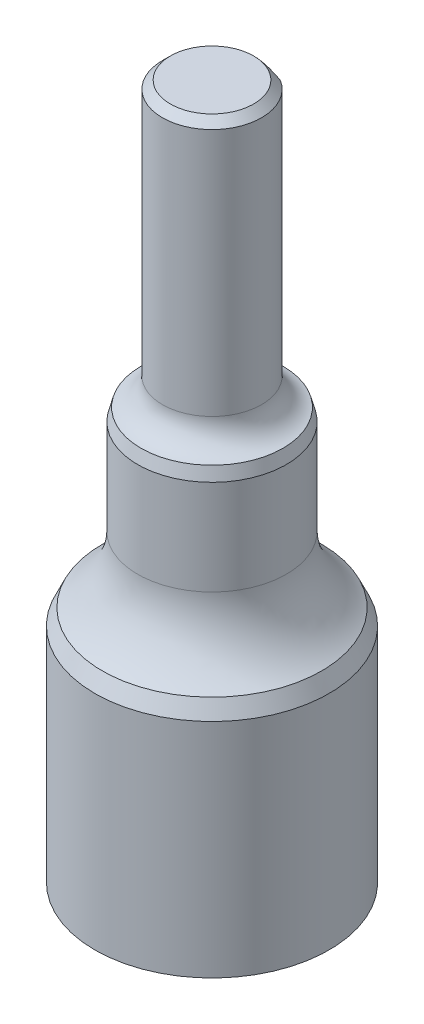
ISO-10303-21;
HEADER;
FILE_DESCRIPTION(('STEP AP214'),'2;1');
FILE_NAME('part.step','',(''),(''),'','','');
FILE_SCHEMA(('AUTOMOTIVE_DESIGN { 1 0 10303 214 1 1 1 1 }'));
ENDSEC;
DATA;
#1=APPLICATION_CONTEXT('core data for automotive mechanical design processes');
#2=APPLICATION_PROTOCOL_DEFINITION('international standard','automotive_design',2000,#1);
#3=PRODUCT_CONTEXT('',#1,'mechanical');
#4=PRODUCT('Part','Part','',(#3));
#5=PRODUCT_RELATED_PRODUCT_CATEGORY('part','',(#4));
#6=PRODUCT_DEFINITION_FORMATION('','',#4);
#7=PRODUCT_DEFINITION_CONTEXT('part definition',#1,'design');
#8=PRODUCT_DEFINITION('design','',#6,#7);
#9=PRODUCT_DEFINITION_SHAPE('','',#8);
#10=(LENGTH_UNIT() NAMED_UNIT(*) SI_UNIT(.MILLI.,.METRE.));
#11=(NAMED_UNIT(*) PLANE_ANGLE_UNIT() SI_UNIT($,.RADIAN.));
#12=(NAMED_UNIT(*) SI_UNIT($,.STERADIAN.) SOLID_ANGLE_UNIT());
#13=UNCERTAINTY_MEASURE_WITH_UNIT(LENGTH_MEASURE(1.E-05),#10,'distance_accuracy_value','');
#14=(GEOMETRIC_REPRESENTATION_CONTEXT(3) GLOBAL_UNCERTAINTY_ASSIGNED_CONTEXT((#13)) GLOBAL_UNIT_ASSIGNED_CONTEXT((#10,
#11,#12)) REPRESENTATION_CONTEXT('',''));
#15=CARTESIAN_POINT('',(0.,0.,0.));
#16=DIRECTION('',(0.,0.,1.));
#17=DIRECTION('',(1.,0.,0.));
#18=AXIS2_PLACEMENT_3D('',#15,#16,#17);
#19=CARTESIAN_POINT('',(0.,122.662819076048,0.));
#20=DIRECTION('',(0.,1.,0.));
#21=DIRECTION('',(0.,0.,1.));
#22=AXIS2_PLACEMENT_3D('',#19,#20,#21);
#23=CYLINDRICAL_SURFACE('',#22,4.7625);
#24=CARTESIAN_POINT('',(0.,25.5523999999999,0.));
#25=DIRECTION('',(0.,-1.,0.));
#26=DIRECTION('',(0.,0.,-1.));
#27=AXIS2_PLACEMENT_3D('',#24,#25,#26);
#28=CIRCLE('',#27,4.7625);
#29=CARTESIAN_POINT('',(0.,25.5523999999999,-4.7625));
#30=VERTEX_POINT('',#29);
#31=EDGE_CURVE('E11',#30,#30,#28,.T.);
#32=ORIENTED_EDGE('',*,*,#31,.T.);
#33=EDGE_LOOP('',(#32));
#34=FACE_BOUND('',#33,.T.);
#35=CARTESIAN_POINT('',(0.,19.4683002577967,0.));
#36=DIRECTION('',(0.,-1.,0.));
#37=DIRECTION('',(0.,0.,-1.));
#38=AXIS2_PLACEMENT_3D('',#35,#36,#37);
#39=CIRCLE('',#38,4.7625);
#40=CARTESIAN_POINT('',(0.,19.4683002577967,-4.7625));
#41=VERTEX_POINT('',#40);
#42=EDGE_CURVE('E74',#41,#41,#39,.F.);
#43=ORIENTED_EDGE('',*,*,#42,.T.);
#44=EDGE_LOOP('',(#43));
#45=FACE_BOUND('',#44,.T.);
#46=ADVANCED_FACE('F17',(#34,#45),#23,.T.);
#47=CARTESIAN_POINT('',(0.,122.662819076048,0.));
#48=DIRECTION('',(0.,1.,0.));
#49=DIRECTION('',(0.,0.,1.));
#50=AXIS2_PLACEMENT_3D('',#47,#48,#49);
#51=CYLINDRICAL_SURFACE('',#50,7.50062);
#52=CARTESIAN_POINT('',(0.,14.224,0.));
#53=DIRECTION('',(0.,-1.,0.));
#54=DIRECTION('',(0.,0.,-1.));
#55=AXIS2_PLACEMENT_3D('',#52,#53,#54);
#56=CIRCLE('',#55,7.50062);
#57=CARTESIAN_POINT('',(0.,14.224,-7.50062));
#58=VERTEX_POINT('',#57);
#59=EDGE_CURVE('E71',#58,#58,#56,.T.);
#60=ORIENTED_EDGE('',*,*,#59,.T.);
#61=EDGE_LOOP('',(#60));
#62=FACE_BOUND('',#61,.T.);
#63=CARTESIAN_POINT('',(0.,0.,0.));
#64=DIRECTION('',(0.,1.,0.));
#65=DIRECTION('',(0.,0.,1.));
#66=AXIS2_PLACEMENT_3D('',#63,#64,#65);
#67=CIRCLE('',#66,7.50062);
#68=CARTESIAN_POINT('',(0.,0.,7.50062));
#69=VERTEX_POINT('',#68);
#70=EDGE_CURVE('E63',#69,#69,#67,.T.);
#71=ORIENTED_EDGE('',*,*,#70,.T.);
#72=EDGE_LOOP('',(#71));
#73=FACE_BOUND('',#72,.T.);
#74=ADVANCED_FACE('F102',(#62,#73),#51,.T.);
#75=CARTESIAN_POINT('',(0.,0.,-7.50062));
#76=DIRECTION('',(0.,1.,0.));
#77=DIRECTION('',(0.,0.,1.));
#78=AXIS2_PLACEMENT_3D('',#75,#76,#77);
#79=PLANE('',#78);
#80=ORIENTED_EDGE('',*,*,#70,.F.);
#81=EDGE_LOOP('',(#80));
#82=FACE_BOUND('',#81,.T.);
#83=ADVANCED_FACE('F108',(#82),#79,.F.);
#84=CARTESIAN_POINT('',(0.,15.24,0.));
#85=DIRECTION('',(0.,-1.,0.));
#86=DIRECTION('',(0.,0.,-1.));
#87=AXIS2_PLACEMENT_3D('',#84,#85,#86);
#88=CONICAL_SURFACE('',#87,7.02685141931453,0.436332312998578);
#89=ORIENTED_EDGE('',*,*,#59,.F.);
#90=EDGE_LOOP('',(#89));
#91=FACE_BOUND('',#90,.T.);
#92=CARTESIAN_POINT('',(0.,15.24,0.));
#93=DIRECTION('',(0.,-1.,0.));
#94=DIRECTION('',(0.,0.,-1.));
#95=AXIS2_PLACEMENT_3D('',#92,#93,#94);
#96=CIRCLE('',#95,7.02685141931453);
#97=CARTESIAN_POINT('',(0.,15.24,-7.02685141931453));
#98=VERTEX_POINT('',#97);
#99=EDGE_CURVE('E68',#98,#98,#96,.F.);
#100=ORIENTED_EDGE('',*,*,#99,.F.);
#101=EDGE_LOOP('',(#100));
#102=FACE_BOUND('',#101,.T.);
#103=ADVANCED_FACE('F111',(#91,#102),#88,.T.);
#104=CARTESIAN_POINT('',(0.,19.4683002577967,0.));
#105=DIRECTION('',(0.,-1.,0.));
#106=DIRECTION('',(0.,0.,-1.));
#107=AXIS2_PLACEMENT_3D('',#104,#105,#106);
#108=TOROIDAL_SURFACE('',#107,9.8425,5.08);
#109=ORIENTED_EDGE('',*,*,#99,.T.);
#110=EDGE_LOOP('',(#109));
#111=FACE_BOUND('',#110,.T.);
#112=ORIENTED_EDGE('',*,*,#42,.F.);
#113=EDGE_LOOP('',(#112));
#114=FACE_BOUND('',#113,.T.);
#115=ADVANCED_FACE('F99',(#111,#114),#108,.F.);
#116=CARTESIAN_POINT('',(0.,26.3144,0.));
#117=DIRECTION('',(0.,1.,0.));
#118=DIRECTION('',(0.,0.,1.));
#119=AXIS2_PLACEMENT_3D('',#116,#117,#118);
#120=CYLINDRICAL_SURFACE('',#119,3.175);
#121=DIRECTION('',(0.,1.,0.));
#122=VECTOR('',#121,1.);
#123=CARTESIAN_POINT('',(1.72271181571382,26.3144,-2.667));
#124=LINE('',#123,#122);
#125=CARTESIAN_POINT('',(1.72271181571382,43.9928,-2.667));
#126=VERTEX_POINT('',#125);
#127=CARTESIAN_POINT('',(1.72271181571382,28.4988,-2.667));
#128=VERTEX_POINT('',#127);
#129=EDGE_CURVE('E55',#126,#128,#124,.F.);
#130=ORIENTED_EDGE('',*,*,#129,.F.);
#131=CARTESIAN_POINT('',(0.,43.9928,0.));
#132=DIRECTION('',(0.,-1.,0.));
#133=DIRECTION('',(0.,0.,-1.));
#134=AXIS2_PLACEMENT_3D('',#131,#132,#133);
#135=CIRCLE('',#134,3.175);
#136=CARTESIAN_POINT('',(-1.72271181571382,43.9928,-2.667));
#137=VERTEX_POINT('',#136);
#138=EDGE_CURVE('E61',#126,#137,#135,.T.);
#139=ORIENTED_EDGE('',*,*,#138,.T.);
#140=DIRECTION('',(0.,1.,0.));
#141=VECTOR('',#140,1.);
#142=CARTESIAN_POINT('',(-1.72271181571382,26.3144,-2.667));
#143=LINE('',#142,#141);
#144=CARTESIAN_POINT('',(-1.72271181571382,28.4988,-2.667));
#145=VERTEX_POINT('',#144);
#146=EDGE_CURVE('E37',#145,#137,#143,.T.);
#147=ORIENTED_EDGE('',*,*,#146,.F.);
#148=CARTESIAN_POINT('',(0.,28.4988,0.));
#149=DIRECTION('',(0.,-1.,0.));
#150=DIRECTION('',(0.,0.,-1.));
#151=AXIS2_PLACEMENT_3D('',#148,#149,#150);
#152=CIRCLE('',#151,3.175);
#153=EDGE_CURVE('E48',#128,#145,#152,.F.);
#154=ORIENTED_EDGE('',*,*,#153,.F.);
#155=EDGE_LOOP('',(#130,#139,#147,#154));
#156=FACE_BOUND('',#155,.T.);
#157=CARTESIAN_POINT('',(0.,28.0821651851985,0.));
#158=DIRECTION('',(0.,-1.,0.));
#159=DIRECTION('',(0.,0.,-1.));
#160=AXIS2_PLACEMENT_3D('',#157,#158,#159);
#161=CIRCLE('',#160,3.175);
#162=CARTESIAN_POINT('',(0.,28.0821651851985,-3.175));
#163=VERTEX_POINT('',#162);
#164=EDGE_CURVE('E77',#163,#163,#161,.F.);
#165=ORIENTED_EDGE('',*,*,#164,.T.);
#166=EDGE_LOOP('',(#165));
#167=FACE_BOUND('',#166,.T.);
#168=ADVANCED_FACE('F58',(#156,#167),#120,.T.);
#169=CARTESIAN_POINT('',(0.,44.5008,0.));
#170=DIRECTION('',(0.,-1.,0.));
#171=DIRECTION('',(0.,0.,-1.));
#172=AXIS2_PLACEMENT_3D('',#169,#170,#171);
#173=PLANE('',#172);
#174=CARTESIAN_POINT('',(0.,44.5008,0.));
#175=DIRECTION('',(0.,-1.,0.));
#176=DIRECTION('',(0.,0.,-1.));
#177=AXIS2_PLACEMENT_3D('',#174,#175,#176);
#178=CIRCLE('',#177,2.667);
#179=CARTESIAN_POINT('',(0.,44.5008,-2.667));
#180=VERTEX_POINT('',#179);
#181=EDGE_CURVE('E80',#180,#180,#178,.F.);
#182=ORIENTED_EDGE('',*,*,#181,.T.);
#183=EDGE_LOOP('',(#182));
#184=FACE_BOUND('',#183,.T.);
#185=ADVANCED_FACE('F98',(#184),#173,.F.);
#186=CARTESIAN_POINT('',(0.,28.0821651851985,0.));
#187=DIRECTION('',(0.,-1.,0.));
#188=DIRECTION('',(0.,0.,-1.));
#189=AXIS2_PLACEMENT_3D('',#186,#187,#188);
#190=TOROIDAL_SURFACE('',#189,4.953,1.778);
#191=CARTESIAN_POINT('',(0.,26.3507709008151,0.));
#192=DIRECTION('',(0.,1.,0.));
#193=DIRECTION('',(0.,0.,1.));
#194=AXIS2_PLACEMENT_3D('',#191,#192,#193);
#195=CIRCLE('',#194,4.54857716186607);
#196=CARTESIAN_POINT('',(0.,26.3507709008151,4.54857716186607));
#197=VERTEX_POINT('',#196);
#198=EDGE_CURVE('E25',#197,#197,#195,.T.);
#199=ORIENTED_EDGE('',*,*,#198,.T.);
#200=EDGE_LOOP('',(#199));
#201=FACE_BOUND('',#200,.T.);
#202=ORIENTED_EDGE('',*,*,#164,.F.);
#203=EDGE_LOOP('',(#202));
#204=FACE_BOUND('',#203,.T.);
#205=ADVANCED_FACE('F106',(#201,#204),#190,.F.);
#206=CARTESIAN_POINT('',(0.,44.5008,0.));
#207=DIRECTION('',(0.,-1.,0.));
#208=DIRECTION('',(0.,0.,-1.));
#209=AXIS2_PLACEMENT_3D('',#206,#207,#208);
#210=CONICAL_SURFACE('',#209,2.667,0.785398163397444);
#211=CARTESIAN_POINT('',(-5.20541471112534,41.3189341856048,-2.667));
#212=CARTESIAN_POINT('',(-5.08515066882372,41.4259509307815,-2.667));
#213=CARTESIAN_POINT('',(-4.96451760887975,41.5325569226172,-2.667));
#214=CARTESIAN_POINT('',(-4.72231766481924,41.7447279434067,-2.667));
#215=CARTESIAN_POINT('',(-4.60075068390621,41.8502928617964,-2.667));
#216=CARTESIAN_POINT('',(-4.35598804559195,42.0605901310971,-2.667));
#217=CARTESIAN_POINT('',(-4.23278763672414,42.1653169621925,-2.667));
#218=CARTESIAN_POINT('',(-3.98502627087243,42.3731395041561,-2.667));
#219=CARTESIAN_POINT('',(-3.86046537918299,42.4762352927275,-2.667));
#220=CARTESIAN_POINT('',(-3.6020947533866,42.6865058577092,-2.667));
#221=CARTESIAN_POINT('',(-3.46818003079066,42.7935520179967,-2.667));
#222=CARTESIAN_POINT('',(-3.19794259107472,43.0045573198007,-2.667));
#223=CARTESIAN_POINT('',(-3.06162002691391,43.1085166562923,-2.667));
#224=CARTESIAN_POINT('',(-2.78610243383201,43.3120714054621,-2.667));
#225=CARTESIAN_POINT('',(-2.64691275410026,43.4116740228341,-2.667));
#226=CARTESIAN_POINT('',(-2.36454752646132,43.6050264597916,-2.667));
#227=CARTESIAN_POINT('',(-2.22137342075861,43.6987783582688,-2.667));
#228=CARTESIAN_POINT('',(-1.97365456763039,43.850910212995,-2.667));
#229=CARTESIAN_POINT('',(-1.87044196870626,43.9114484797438,-2.667));
#230=CARTESIAN_POINT('',(-1.66094528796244,44.0271012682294,-2.667));
#231=CARTESIAN_POINT('',(-1.55466025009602,44.0822140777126,-2.667));
#232=CARTESIAN_POINT('',(-1.3395505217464,44.1847772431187,-2.667));
#233=CARTESIAN_POINT('',(-1.23075603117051,44.2322901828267,-2.667));
#234=CARTESIAN_POINT('',(-1.00952772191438,44.3179466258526,-2.667));
#235=CARTESIAN_POINT('',(-0.897096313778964,44.3560961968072,-2.667));
#236=CARTESIAN_POINT('',(-0.705363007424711,44.4101049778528,-2.667));
#237=CARTESIAN_POINT('',(-0.62697156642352,44.4291906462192,-2.667));
#238=CARTESIAN_POINT('',(-0.468900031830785,44.460999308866,-2.667));
#239=CARTESIAN_POINT('',(-0.389220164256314,44.4737234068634,-2.667));
#240=CARTESIAN_POINT('',(-0.229320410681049,44.4921328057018,-2.667));
#241=CARTESIAN_POINT('',(-0.149103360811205,44.4978423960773,-2.667));
#242=CARTESIAN_POINT('',(0.0115223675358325,44.5019835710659,-2.667));
#243=CARTESIAN_POINT('',(0.0919310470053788,44.5004151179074,-2.667));
#244=CARTESIAN_POINT('',(0.251869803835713,44.4901166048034,-2.667));
#245=CARTESIAN_POINT('',(0.331402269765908,44.481423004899,-2.667));
#246=CARTESIAN_POINT('',(0.489459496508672,44.4573844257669,-2.667));
#247=CARTESIAN_POINT('',(0.567984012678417,44.4420378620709,-2.667));
#248=CARTESIAN_POINT('',(0.724495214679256,44.40520557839,-2.667));
#249=CARTESIAN_POINT('',(0.802465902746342,44.3836527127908,-2.667));
#250=CARTESIAN_POINT('',(0.956737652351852,44.3353332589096,-2.667));
#251=CARTESIAN_POINT('',(1.03303902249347,44.3085676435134,-2.667));
#252=CARTESIAN_POINT('',(1.20964279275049,44.2407891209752,-2.667));
#253=CARTESIAN_POINT('',(1.30927136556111,44.1980281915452,-2.667));
#254=CARTESIAN_POINT('',(1.50568115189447,44.106360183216,-2.667));
#255=CARTESIAN_POINT('',(1.60246075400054,44.0574497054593,-2.667));
#256=CARTESIAN_POINT('',(1.79379964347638,43.9546907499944,-2.667));
#257=CARTESIAN_POINT('',(1.88834947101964,43.9008247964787,-2.667));
#258=CARTESIAN_POINT('',(2.07519567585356,43.7893823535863,-2.667));
#259=CARTESIAN_POINT('',(2.16749249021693,43.7318065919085,-2.667));
#260=CARTESIAN_POINT('',(2.34561607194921,43.6166843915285,-2.667));
#261=CARTESIAN_POINT('',(2.43153551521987,43.5592806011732,-2.667));
#262=CARTESIAN_POINT('',(2.60191804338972,43.4423429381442,-2.667));
#263=CARTESIAN_POINT('',(2.68638101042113,43.382808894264,-2.667));
#264=CARTESIAN_POINT('',(2.85331615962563,43.2625504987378,-2.667));
#265=CARTESIAN_POINT('',(2.93579935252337,43.2018413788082,-2.667));
#266=CARTESIAN_POINT('',(3.09968837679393,43.0790290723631,-2.667));
#267=CARTESIAN_POINT('',(3.18109448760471,43.0169262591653,-2.667));
#268=CARTESIAN_POINT('',(3.26205789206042,42.9542610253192,-2.667));
#269=B_SPLINE_CURVE_WITH_KNOTS('',3,(#211,#212,#213,#214,#215,#216,#217,#218,#219,#220,#221,
#222,#223,#224,#225,#226,#227,#228,#229,#230,#231,#232,#233,#234,#235,#236,#237,#238,#239,#240,
#241,#242,#243,#244,#245,#246,#247,#248,#249,#250,#251,#252,#253,#254,#255,#256,#257,#258,#259,
#260,#261,#262,#263,#264,#265,#266,#267,#268),.UNSPECIFIED.,.F.,.F.,(4,2,2,2,2,2,2,2,2,2,2,2,2,
2,2,2,2,2,2,2,2,2,2,2,2,2,2,2,4),(0.,0.48295659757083,0.965963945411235,1.45104485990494,
1.93610259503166,2.45039267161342,2.96465019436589,3.47802238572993,3.99121111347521,
4.35006103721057,4.70902385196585,5.06485876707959,5.42046248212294,5.66228286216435,
5.90406127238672,6.14500008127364,6.38594014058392,6.62565492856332,6.86542683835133,
7.10789710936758,7.35032217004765,7.67529103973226,8.00044031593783,8.32678375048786,
8.65306336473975,8.96301902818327,9.27299965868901,9.58023217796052,9.88738336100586),.UNSPECIFIED.);
#270=EDGE_CURVE('E32',#137,#180,#269,.T.);
#271=ORIENTED_EDGE('',*,*,#270,.F.);
#272=ORIENTED_EDGE('',*,*,#138,.F.);
#273=EDGE_CURVE('E84',#180,#126,#269,.T.);
#274=ORIENTED_EDGE('',*,*,#273,.F.);
#275=ORIENTED_EDGE('',*,*,#181,.F.);
#276=EDGE_LOOP('',(#271,#272,#274,#275));
#277=FACE_BOUND('',#276,.T.);
#278=ADVANCED_FACE('F89',(#277),#210,.T.);
#279=CARTESIAN_POINT('',(6.63212456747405,28.4988,-2.667));
#280=DIRECTION('',(0.,0.,1.));
#281=DIRECTION('',(1.,0.,0.));
#282=AXIS2_PLACEMENT_3D('',#279,#280,#281);
#283=PLANE('',#282);
#284=ORIENTED_EDGE('',*,*,#129,.T.);
#285=DIRECTION('',(1.,0.,0.));
#286=VECTOR('',#285,1.);
#287=CARTESIAN_POINT('',(6.63212456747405,28.4988,-2.667));
#288=LINE('',#287,#286);
#289=EDGE_CURVE('E50',#145,#128,#288,.T.);
#290=ORIENTED_EDGE('',*,*,#289,.F.);
#291=ORIENTED_EDGE('',*,*,#146,.T.);
#292=ORIENTED_EDGE('',*,*,#270,.T.);
#293=ORIENTED_EDGE('',*,*,#273,.T.);
#294=EDGE_LOOP('',(#284,#290,#291,#292,#293));
#295=FACE_BOUND('',#294,.T.);
#296=ADVANCED_FACE('F54',(#295),#283,.F.);
#297=CARTESIAN_POINT('',(6.63212456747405,28.4988,-2.667));
#298=DIRECTION('',(0.,-1.,0.));
#299=DIRECTION('',(0.,0.,-1.));
#300=AXIS2_PLACEMENT_3D('',#297,#298,#299);
#301=PLANE('',#300);
#302=ORIENTED_EDGE('',*,*,#153,.T.);
#303=ORIENTED_EDGE('',*,*,#289,.T.);
#304=EDGE_LOOP('',(#302,#303));
#305=FACE_BOUND('',#304,.T.);
#306=ADVANCED_FACE('F49',(#305),#301,.F.);
#307=CARTESIAN_POINT('',(0.,26.3507709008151,0.));
#308=DIRECTION('',(0.,-1.,0.));
#309=DIRECTION('',(0.,0.,-1.));
#310=AXIS2_PLACEMENT_3D('',#307,#308,#309);
#311=CONICAL_SURFACE('',#310,4.54857716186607,0.261799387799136);
#312=ORIENTED_EDGE('',*,*,#31,.F.);
#313=EDGE_LOOP('',(#312));
#314=FACE_BOUND('',#313,.T.);
#315=ORIENTED_EDGE('',*,*,#198,.F.);
#316=EDGE_LOOP('',(#315));
#317=FACE_BOUND('',#316,.T.);
#318=ADVANCED_FACE('F19',(#314,#317),#311,.T.);
#319=CLOSED_SHELL('',(#46,#74,#83,#103,#115,#168,#185,#205,#278,#296,#306,#318));
#320=MANIFOLD_SOLID_BREP('B1',#319);
#321=ADVANCED_BREP_SHAPE_REPRESENTATION('',(#18,#320),#14);
#322=SHAPE_DEFINITION_REPRESENTATION(#9,#321);
ENDSEC;
END-ISO-10303-21;
